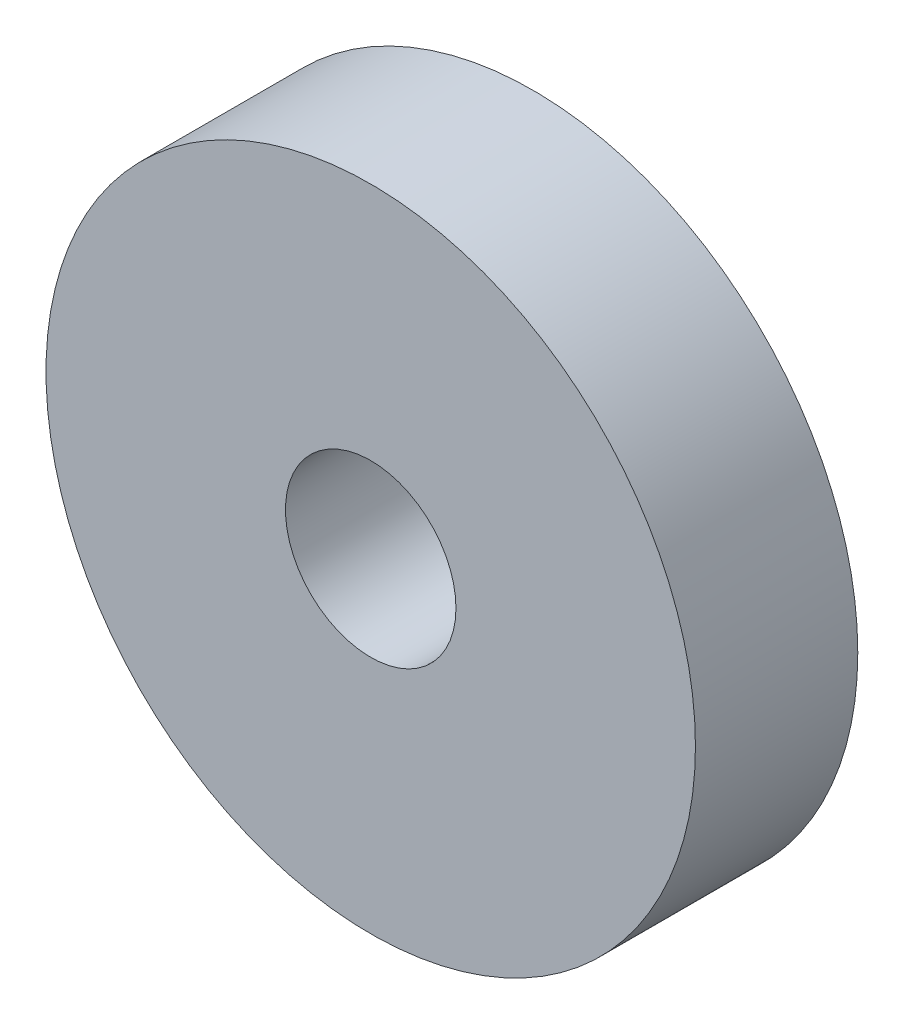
ISO-10303-21;
HEADER;
FILE_DESCRIPTION(('STEP AP214'),'2;1');
FILE_NAME('part.step','',(''),(''),'','','');
FILE_SCHEMA(('AUTOMOTIVE_DESIGN { 1 0 10303 214 1 1 1 1 }'));
ENDSEC;
DATA;
#1=APPLICATION_CONTEXT('core data for automotive mechanical design processes');
#2=APPLICATION_PROTOCOL_DEFINITION('international standard','automotive_design',2000,#1);
#3=PRODUCT_CONTEXT('',#1,'mechanical');
#4=PRODUCT('Part','Part','',(#3));
#5=PRODUCT_RELATED_PRODUCT_CATEGORY('part','',(#4));
#6=PRODUCT_DEFINITION_FORMATION('','',#4);
#7=PRODUCT_DEFINITION_CONTEXT('part definition',#1,'design');
#8=PRODUCT_DEFINITION('design','',#6,#7);
#9=PRODUCT_DEFINITION_SHAPE('','',#8);
#10=(LENGTH_UNIT() NAMED_UNIT(*) SI_UNIT(.MILLI.,.METRE.));
#11=(NAMED_UNIT(*) PLANE_ANGLE_UNIT() SI_UNIT($,.RADIAN.));
#12=(NAMED_UNIT(*) SI_UNIT($,.STERADIAN.) SOLID_ANGLE_UNIT());
#13=UNCERTAINTY_MEASURE_WITH_UNIT(LENGTH_MEASURE(1.E-05),#10,'distance_accuracy_value','');
#14=(GEOMETRIC_REPRESENTATION_CONTEXT(3) GLOBAL_UNCERTAINTY_ASSIGNED_CONTEXT((#13)) GLOBAL_UNIT_ASSIGNED_CONTEXT((#10,
#11,#12)) REPRESENTATION_CONTEXT('',''));
#15=CARTESIAN_POINT('',(0.,0.,0.));
#16=DIRECTION('',(0.,0.,1.));
#17=DIRECTION('',(1.,0.,0.));
#18=AXIS2_PLACEMENT_3D('',#15,#16,#17);
#19=CARTESIAN_POINT('',(0.,0.,10.));
#20=DIRECTION('',(0.,0.,1.));
#21=DIRECTION('',(1.,0.,0.));
#22=AXIS2_PLACEMENT_3D('',#19,#20,#21);
#23=PLANE('',#22);
#24=CARTESIAN_POINT('',(0.,0.,10.));
#25=DIRECTION('',(0.,0.,1.));
#26=DIRECTION('',(1.,0.,0.));
#27=AXIS2_PLACEMENT_3D('',#24,#25,#26);
#28=CIRCLE('',#27,20.);
#29=CARTESIAN_POINT('',(20.,0.,10.));
#30=VERTEX_POINT('',#29);
#31=EDGE_CURVE('E8',#30,#30,#28,.T.);
#32=ORIENTED_EDGE('',*,*,#31,.T.);
#33=EDGE_LOOP('',(#32));
#34=FACE_BOUND('',#33,.T.);
#35=CARTESIAN_POINT('',(0.,0.,10.));
#36=DIRECTION('',(0.,0.,1.));
#37=DIRECTION('',(1.,0.,0.));
#38=AXIS2_PLACEMENT_3D('',#35,#36,#37);
#39=CIRCLE('',#38,5.25);
#40=CARTESIAN_POINT('',(5.25,0.,10.));
#41=VERTEX_POINT('',#40);
#42=EDGE_CURVE('E23',#41,#41,#39,.T.);
#43=ORIENTED_EDGE('',*,*,#42,.F.);
#44=EDGE_LOOP('',(#43));
#45=FACE_BOUND('',#44,.T.);
#46=ADVANCED_FACE('F12',(#34,#45),#23,.T.);
#47=CARTESIAN_POINT('',(0.,0.,0.));
#48=DIRECTION('',(0.,0.,1.));
#49=DIRECTION('',(1.,0.,0.));
#50=AXIS2_PLACEMENT_3D('',#47,#48,#49);
#51=PLANE('',#50);
#52=CARTESIAN_POINT('',(0.,0.,0.));
#53=DIRECTION('',(0.,0.,1.));
#54=DIRECTION('',(1.,0.,0.));
#55=AXIS2_PLACEMENT_3D('',#52,#53,#54);
#56=CIRCLE('',#55,20.);
#57=CARTESIAN_POINT('',(20.,0.,0.));
#58=VERTEX_POINT('',#57);
#59=EDGE_CURVE('E19',#58,#58,#56,.T.);
#60=ORIENTED_EDGE('',*,*,#59,.F.);
#61=EDGE_LOOP('',(#60));
#62=FACE_BOUND('',#61,.T.);
#63=CARTESIAN_POINT('',(0.,0.,0.));
#64=DIRECTION('',(0.,0.,1.));
#65=DIRECTION('',(1.,0.,0.));
#66=AXIS2_PLACEMENT_3D('',#63,#64,#65);
#67=CIRCLE('',#66,5.25);
#68=CARTESIAN_POINT('',(5.25,0.,0.));
#69=VERTEX_POINT('',#68);
#70=EDGE_CURVE('E27',#69,#69,#67,.T.);
#71=ORIENTED_EDGE('',*,*,#70,.T.);
#72=EDGE_LOOP('',(#71));
#73=FACE_BOUND('',#72,.T.);
#74=ADVANCED_FACE('F33',(#62,#73),#51,.F.);
#75=CARTESIAN_POINT('',(0.,0.,10.));
#76=DIRECTION('',(0.,0.,-1.));
#77=DIRECTION('',(-1.,0.,0.));
#78=AXIS2_PLACEMENT_3D('',#75,#76,#77);
#79=CYLINDRICAL_SURFACE('',#78,20.);
#80=ORIENTED_EDGE('',*,*,#31,.F.);
#81=EDGE_LOOP('',(#80));
#82=FACE_BOUND('',#81,.T.);
#83=ORIENTED_EDGE('',*,*,#59,.T.);
#84=EDGE_LOOP('',(#83));
#85=FACE_BOUND('',#84,.T.);
#86=ADVANCED_FACE('F14',(#82,#85),#79,.T.);
#87=CARTESIAN_POINT('',(0.,0.,10.));
#88=DIRECTION('',(0.,0.,-1.));
#89=DIRECTION('',(-1.,0.,0.));
#90=AXIS2_PLACEMENT_3D('',#87,#88,#89);
#91=CYLINDRICAL_SURFACE('',#90,5.25);
#92=ORIENTED_EDGE('',*,*,#42,.T.);
#93=EDGE_LOOP('',(#92));
#94=FACE_BOUND('',#93,.T.);
#95=ORIENTED_EDGE('',*,*,#70,.F.);
#96=EDGE_LOOP('',(#95));
#97=FACE_BOUND('',#96,.T.);
#98=ADVANCED_FACE('F35',(#94,#97),#91,.F.);
#99=CLOSED_SHELL('',(#46,#74,#86,#98));
#100=MANIFOLD_SOLID_BREP('B1',#99);
#101=ADVANCED_BREP_SHAPE_REPRESENTATION('',(#18,#100),#14);
#102=SHAPE_DEFINITION_REPRESENTATION(#9,#101);
ENDSEC;
END-ISO-10303-21;
